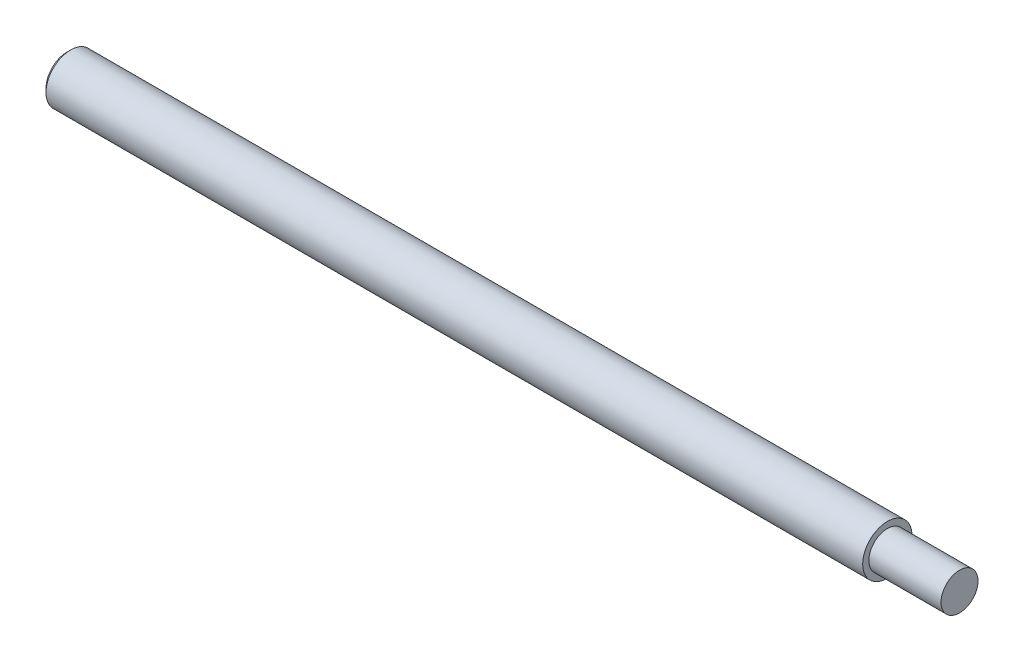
from build123d import *

# Parameters (mm, degrees)
CHANFREIN1_SIZE = 3


with BuildPart() as part:
    # Esquisse1 → R_volution1 (revolve)
    with BuildSketch(Plane.XY, mode=Mode.PRIVATE) as r_volution1_sk:
        Polygon((0, 0), (0, 20), (665, 20), (665, 15), (723.5, 15), (723.5, 0), align=None)
    revolve(r_volution1_sk.sketch.rotate(Axis((0, 0, 0), (1, 0, 0)), 90), axis=Axis((0, 0, 0), (1, 0, 0)))

    # Chanfrein1
    chanfrein1_edges = [part.edges().sort_by_distance(p)[0] for p in [
        (0, 0, -20),
    ]]
    chamfer(chanfrein1_edges, length=CHANFREIN1_SIZE)


solid = part.part
